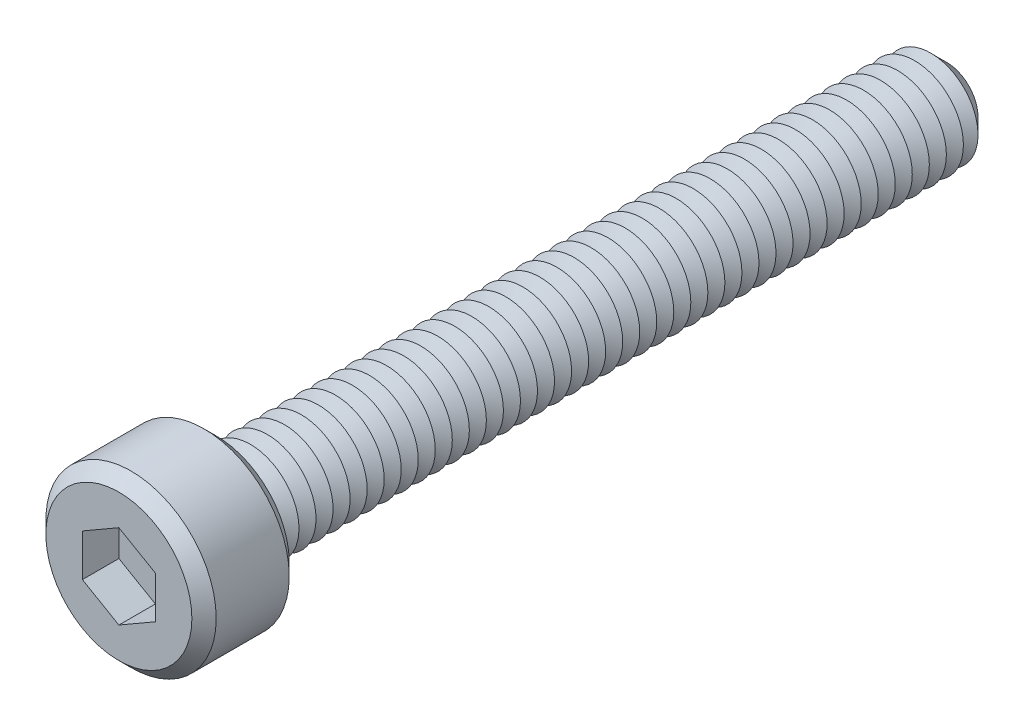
from build123d import *

# Parameters (mm, degrees)
SKETCH1_R           = 3.5
BOSS_EXTRUDE1_DEPTH = 4
SKETCH2_R           = 2
BOSS_EXTRUDE2_DEPTH = 30
CHAMFER1_SIZE       = 0.7
LPATTERN1_COUNT     = 42
LPATTERN1_PITCH     = 0.7
CUT_EXTRUDE1_DEPTH  = 1.5
SKETCH6_R           = 0.5
CUT_EXTRUDE2_DEPTH  = 32.5
CHAMFER2_SIZE       = 0.5


with BuildPart() as part:
    # Sketch1 → Boss-Extrude1 (new body)
    with BuildSketch(Plane.XY):
        Circle(SKETCH1_R)
    extrude(amount=BOSS_EXTRUDE1_DEPTH)

    # Sketch2 → Boss-Extrude2 (add)
    with BuildSketch(Plane(origin=(0, 0, 0), x_dir=(-1, 0, 0), z_dir=(0, 0, -1))):
        Circle(SKETCH2_R)
    extrude(amount=BOSS_EXTRUDE2_DEPTH)

    # Chamfer1
    chamfer1_edges = [part.edges().sort_by_distance(p)[0] for p in [
        (2, 0, -30),
    ]]
    chamfer(chamfer1_edges, length=CHAMFER1_SIZE)

    # Sketch4 → Cut-Revolve1 (revolve, cut)
    with BuildSketch(Plane(origin=(0, 0, 0), x_dir=(0, 0, -1), z_dir=(1, 0, 0)), mode=Mode.PRIVATE) as cut_revolve1_sk:
        Polygon((0, 2), (0.35, 1.393782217), (0.7, 2), align=None)
    cut_revolve1 = revolve(cut_revolve1_sk.sketch.rotate(Axis((0, 0, 2.512122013), (0, 0, -1)), 90), axis=Axis((0, 0, 2.512122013), (0, 0, -1)), mode=Mode.SUBTRACT)

    # LPattern1: Cut-Revolve1 ×42
    with Locations(*[(0, 0, -i * LPATTERN1_PITCH) for i in range(1, LPATTERN1_COUNT)]):
        add(cut_revolve1, mode=Mode.SUBTRACT)

    # Sketch5 → Cut-Extrude1 (cut)
    with BuildSketch(Plane.XY.offset(4)):
        Polygon((0, 1.732050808), (-1.5, 0.866025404), (-1.5, -0.866025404), (0, -1.732050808), (1.5, -0.866025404), (1.5, 0.866025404), align=None)
    extrude(amount=-CUT_EXTRUDE1_DEPTH, mode=Mode.SUBTRACT)

    # Sketch6 → Cut-Extrude2 (cut)
    with BuildSketch(Plane.XY.offset(2.5)):
        Circle(SKETCH6_R)
    extrude(amount=-CUT_EXTRUDE2_DEPTH, mode=Mode.SUBTRACT)

    # Chamfer2
    chamfer2_edges = [part.edges().sort_by_distance(p)[0] for p in [
        (-3.5, 0, 0),
        (-3.5, 0, 4),
    ]]
    chamfer(chamfer2_edges, length=CHAMFER2_SIZE)


solid = part.part
